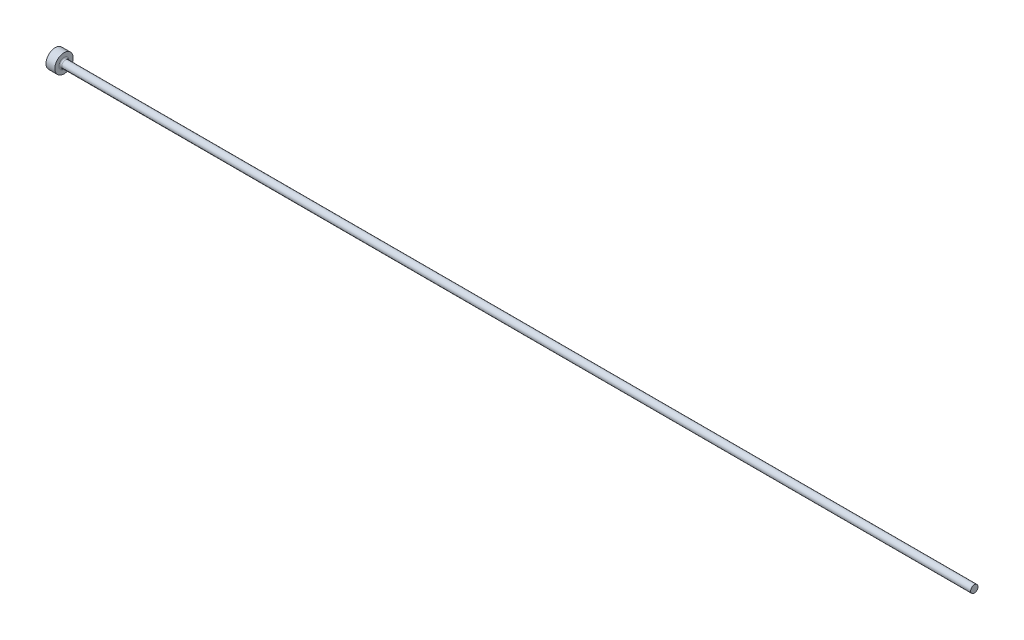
ISO-10303-21;
HEADER;
FILE_DESCRIPTION(('STEP AP214'),'2;1');
FILE_NAME('part.step','',(''),(''),'','','');
FILE_SCHEMA(('AUTOMOTIVE_DESIGN { 1 0 10303 214 1 1 1 1 }'));
ENDSEC;
DATA;
#1=APPLICATION_CONTEXT('core data for automotive mechanical design processes');
#2=APPLICATION_PROTOCOL_DEFINITION('international standard','automotive_design',2000,#1);
#3=PRODUCT_CONTEXT('',#1,'mechanical');
#4=PRODUCT('Part','Part','',(#3));
#5=PRODUCT_RELATED_PRODUCT_CATEGORY('part','',(#4));
#6=PRODUCT_DEFINITION_FORMATION('','',#4);
#7=PRODUCT_DEFINITION_CONTEXT('part definition',#1,'design');
#8=PRODUCT_DEFINITION('design','',#6,#7);
#9=PRODUCT_DEFINITION_SHAPE('','',#8);
#10=(LENGTH_UNIT() NAMED_UNIT(*) SI_UNIT(.MILLI.,.METRE.));
#11=(NAMED_UNIT(*) PLANE_ANGLE_UNIT() SI_UNIT($,.RADIAN.));
#12=(NAMED_UNIT(*) SI_UNIT($,.STERADIAN.) SOLID_ANGLE_UNIT());
#13=UNCERTAINTY_MEASURE_WITH_UNIT(LENGTH_MEASURE(1.E-05),#10,'distance_accuracy_value','');
#14=(GEOMETRIC_REPRESENTATION_CONTEXT(3) GLOBAL_UNCERTAINTY_ASSIGNED_CONTEXT((#13)) GLOBAL_UNIT_ASSIGNED_CONTEXT((#10,
#11,#12)) REPRESENTATION_CONTEXT('',''));
#15=CARTESIAN_POINT('',(0.,0.,0.));
#16=DIRECTION('',(0.,0.,1.));
#17=DIRECTION('',(1.,0.,0.));
#18=AXIS2_PLACEMENT_3D('',#15,#16,#17);
#19=CARTESIAN_POINT('',(0.,0.,0.));
#20=DIRECTION('',(-1.,0.,0.));
#21=DIRECTION('',(0.,-1.,0.));
#22=AXIS2_PLACEMENT_3D('',#19,#20,#21);
#23=PLANE('',#22);
#24=CARTESIAN_POINT('',(0.,0.,0.));
#25=DIRECTION('',(1.,0.,0.));
#26=DIRECTION('',(0.,1.,0.));
#27=AXIS2_PLACEMENT_3D('',#24,#25,#26);
#28=CIRCLE('',#27,1.25);
#29=CARTESIAN_POINT('',(0.,1.25,0.));
#30=VERTEX_POINT('',#29);
#31=EDGE_CURVE('E24',#30,#30,#28,.T.);
#32=ORIENTED_EDGE('',*,*,#31,.F.);
#33=EDGE_LOOP('',(#32));
#34=FACE_BOUND('',#33,.T.);
#35=ADVANCED_FACE('F13',(#34),#23,.T.);
#36=CARTESIAN_POINT('',(125.,0.,0.));
#37=DIRECTION('',(1.,0.,0.));
#38=DIRECTION('',(0.,1.,0.));
#39=AXIS2_PLACEMENT_3D('',#36,#37,#38);
#40=CYLINDRICAL_SURFACE('',#39,1.25);
#41=ORIENTED_EDGE('',*,*,#31,.T.);
#42=EDGE_LOOP('',(#41));
#43=FACE_BOUND('',#42,.T.);
#44=CARTESIAN_POINT('',(1.2,0.,0.));
#45=DIRECTION('',(1.,0.,0.));
#46=DIRECTION('',(0.,1.,0.));
#47=AXIS2_PLACEMENT_3D('',#44,#45,#46);
#48=CIRCLE('',#47,1.25);
#49=CARTESIAN_POINT('',(1.2,1.25,0.));
#50=VERTEX_POINT('',#49);
#51=EDGE_CURVE('E28',#50,#50,#48,.T.);
#52=ORIENTED_EDGE('',*,*,#51,.F.);
#53=EDGE_LOOP('',(#52));
#54=FACE_BOUND('',#53,.T.);
#55=ADVANCED_FACE('F50',(#43,#54),#40,.T.);
#56=CARTESIAN_POINT('',(1.2,1.25,0.));
#57=DIRECTION('',(1.,0.,0.));
#58=DIRECTION('',(0.,1.,0.));
#59=AXIS2_PLACEMENT_3D('',#56,#57,#58);
#60=PLANE('',#59);
#61=CARTESIAN_POINT('',(1.2,0.,0.));
#62=DIRECTION('',(1.,0.,0.));
#63=DIRECTION('',(0.,1.,0.));
#64=AXIS2_PLACEMENT_3D('',#61,#62,#63);
#65=CIRCLE('',#64,0.699999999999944);
#66=CARTESIAN_POINT('',(1.2,0.699999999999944,0.));
#67=VERTEX_POINT('',#66);
#68=EDGE_CURVE('E8',#67,#67,#65,.F.);
#69=ORIENTED_EDGE('',*,*,#68,.T.);
#70=EDGE_LOOP('',(#69));
#71=FACE_BOUND('',#70,.T.);
#72=ORIENTED_EDGE('',*,*,#51,.T.);
#73=EDGE_LOOP('',(#72));
#74=FACE_BOUND('',#73,.T.);
#75=ADVANCED_FACE('F41',(#71,#74),#60,.T.);
#76=CARTESIAN_POINT('',(125.,0.,0.));
#77=DIRECTION('',(1.,0.,0.));
#78=DIRECTION('',(0.,1.,0.));
#79=AXIS2_PLACEMENT_3D('',#76,#77,#78);
#80=CYLINDRICAL_SURFACE('',#79,0.499999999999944);
#81=CARTESIAN_POINT('',(1.4,0.,0.));
#82=DIRECTION('',(1.,0.,0.));
#83=DIRECTION('',(0.,1.,0.));
#84=AXIS2_PLACEMENT_3D('',#81,#82,#83);
#85=CIRCLE('',#84,0.499999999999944);
#86=CARTESIAN_POINT('',(1.4,0.499999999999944,0.));
#87=VERTEX_POINT('',#86);
#88=EDGE_CURVE('E20',#87,#87,#85,.T.);
#89=ORIENTED_EDGE('',*,*,#88,.T.);
#90=EDGE_LOOP('',(#89));
#91=FACE_BOUND('',#90,.T.);
#92=CARTESIAN_POINT('',(125.,0.,0.));
#93=DIRECTION('',(1.,0.,0.));
#94=DIRECTION('',(0.,1.,0.));
#95=AXIS2_PLACEMENT_3D('',#92,#93,#94);
#96=CIRCLE('',#95,0.499999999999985);
#97=CARTESIAN_POINT('',(125.,0.499999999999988,0.));
#98=VERTEX_POINT('',#97);
#99=EDGE_CURVE('E33',#98,#98,#96,.T.);
#100=ORIENTED_EDGE('',*,*,#99,.F.);
#101=EDGE_LOOP('',(#100));
#102=FACE_BOUND('',#101,.T.);
#103=ADVANCED_FACE('F39',(#91,#102),#80,.T.);
#104=CARTESIAN_POINT('',(125.,0.499999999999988,0.));
#105=DIRECTION('',(1.,0.,0.));
#106=DIRECTION('',(0.,1.,0.));
#107=AXIS2_PLACEMENT_3D('',#104,#105,#106);
#108=PLANE('',#107);
#109=ORIENTED_EDGE('',*,*,#99,.T.);
#110=EDGE_LOOP('',(#109));
#111=FACE_BOUND('',#110,.T.);
#112=ADVANCED_FACE('F37',(#111),#108,.T.);
#113=CARTESIAN_POINT('',(1.4,0.,0.));
#114=DIRECTION('',(1.,0.,0.));
#115=DIRECTION('',(0.,1.,0.));
#116=AXIS2_PLACEMENT_3D('',#113,#114,#115);
#117=TOROIDAL_SURFACE('',#116,0.699999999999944,0.2);
#118=ORIENTED_EDGE('',*,*,#68,.F.);
#119=EDGE_LOOP('',(#118));
#120=FACE_BOUND('',#119,.T.);
#121=ORIENTED_EDGE('',*,*,#88,.F.);
#122=EDGE_LOOP('',(#121));
#123=FACE_BOUND('',#122,.T.);
#124=ADVANCED_FACE('F15',(#120,#123),#117,.F.);
#125=CLOSED_SHELL('',(#35,#55,#75,#103,#112,#124));
#126=MANIFOLD_SOLID_BREP('B1',#125);
#127=ADVANCED_BREP_SHAPE_REPRESENTATION('',(#18,#126),#14);
#128=SHAPE_DEFINITION_REPRESENTATION(#9,#127);
ENDSEC;
END-ISO-10303-21;
